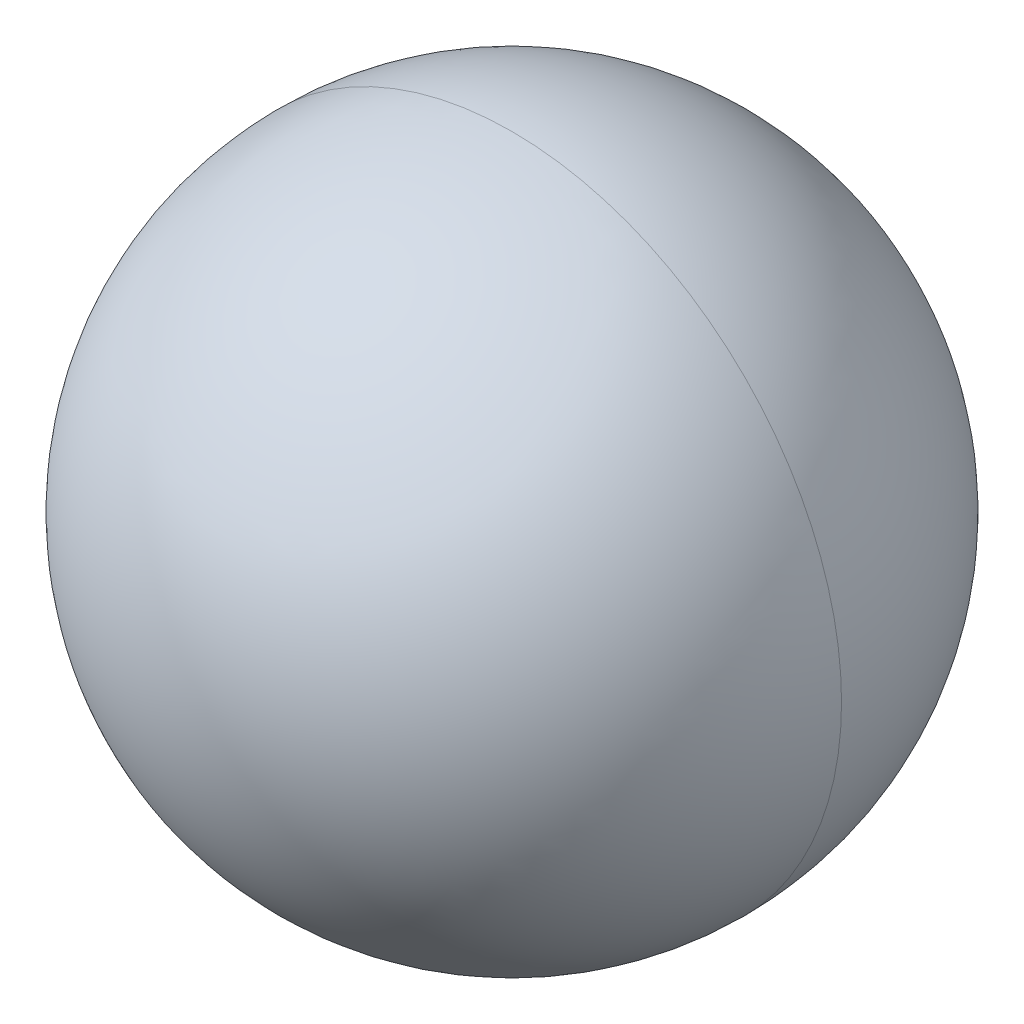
ISO-10303-21;
HEADER;
FILE_DESCRIPTION(('STEP AP214'),'2;1');
FILE_NAME('part.step','',(''),(''),'','','');
FILE_SCHEMA(('AUTOMOTIVE_DESIGN { 1 0 10303 214 1 1 1 1 }'));
ENDSEC;
DATA;
#1=APPLICATION_CONTEXT('core data for automotive mechanical design processes');
#2=APPLICATION_PROTOCOL_DEFINITION('international standard','automotive_design',2000,#1);
#3=PRODUCT_CONTEXT('',#1,'mechanical');
#4=PRODUCT('Part','Part','',(#3));
#5=PRODUCT_RELATED_PRODUCT_CATEGORY('part','',(#4));
#6=PRODUCT_DEFINITION_FORMATION('','',#4);
#7=PRODUCT_DEFINITION_CONTEXT('part definition',#1,'design');
#8=PRODUCT_DEFINITION('design','',#6,#7);
#9=PRODUCT_DEFINITION_SHAPE('','',#8);
#10=(LENGTH_UNIT() NAMED_UNIT(*) SI_UNIT(.MILLI.,.METRE.));
#11=(NAMED_UNIT(*) PLANE_ANGLE_UNIT() SI_UNIT($,.RADIAN.));
#12=(NAMED_UNIT(*) SI_UNIT($,.STERADIAN.) SOLID_ANGLE_UNIT());
#13=UNCERTAINTY_MEASURE_WITH_UNIT(LENGTH_MEASURE(1.E-05),#10,'distance_accuracy_value','');
#14=(GEOMETRIC_REPRESENTATION_CONTEXT(3) GLOBAL_UNCERTAINTY_ASSIGNED_CONTEXT((#13)) GLOBAL_UNIT_ASSIGNED_CONTEXT((#10,
#11,#12)) REPRESENTATION_CONTEXT('',''));
#15=CARTESIAN_POINT('',(0.,0.,0.));
#16=DIRECTION('',(0.,0.,1.));
#17=DIRECTION('',(1.,0.,0.));
#18=AXIS2_PLACEMENT_3D('',#15,#16,#17);
#19=CARTESIAN_POINT('',(0.,12.6365,0.));
#20=DIRECTION('',(0.,0.,-1.));
#21=DIRECTION('',(1.,0.,0.));
#22=AXIS2_PLACEMENT_3D('',#19,#20,#21);
#23=SPHERICAL_SURFACE('',#22,7.9375);
#24=CARTESIAN_POINT('',(0.,12.6365,0.));
#25=DIRECTION('',(0.,0.,-1.));
#26=DIRECTION('',(-1.,0.,0.));
#27=AXIS2_PLACEMENT_3D('',#24,#25,#26);
#28=CIRCLE('',#27,7.9375);
#29=CARTESIAN_POINT('',(0.,4.699,0.));
#30=VERTEX_POINT('',#29);
#31=CARTESIAN_POINT('',(0.,20.574,0.));
#32=VERTEX_POINT('',#31);
#33=EDGE_CURVE('E11',#30,#32,#28,.T.);
#34=ORIENTED_EDGE('',*,*,#33,.F.);
#35=CARTESIAN_POINT('',(0.,12.6365,0.));
#36=DIRECTION('',(0.,0.,1.));
#37=DIRECTION('',(1.,0.,0.));
#38=AXIS2_PLACEMENT_3D('',#35,#36,#37);
#39=CIRCLE('',#38,7.9375);
#40=EDGE_CURVE('E19',#30,#32,#39,.T.);
#41=ORIENTED_EDGE('',*,*,#40,.T.);
#42=EDGE_LOOP('',(#34,#41));
#43=FACE_BOUND('',#42,.T.);
#44=ADVANCED_FACE('F16',(#43),#23,.T.);
#45=CARTESIAN_POINT('',(0.,12.6365,0.));
#46=DIRECTION('',(0.,0.,-1.));
#47=DIRECTION('',(1.,0.,0.));
#48=AXIS2_PLACEMENT_3D('',#45,#46,#47);
#49=SPHERICAL_SURFACE('',#48,7.9375);
#50=ORIENTED_EDGE('',*,*,#40,.F.);
#51=ORIENTED_EDGE('',*,*,#33,.T.);
#52=EDGE_LOOP('',(#50,#51));
#53=FACE_BOUND('',#52,.T.);
#54=ADVANCED_FACE('F40',(#53),#49,.T.);
#55=CLOSED_SHELL('',(#44,#54));
#56=MANIFOLD_SOLID_BREP('B1',#55);
#57=ADVANCED_BREP_SHAPE_REPRESENTATION('',(#18,#56),#14);
#58=SHAPE_DEFINITION_REPRESENTATION(#9,#57);
ENDSEC;
END-ISO-10303-21;
